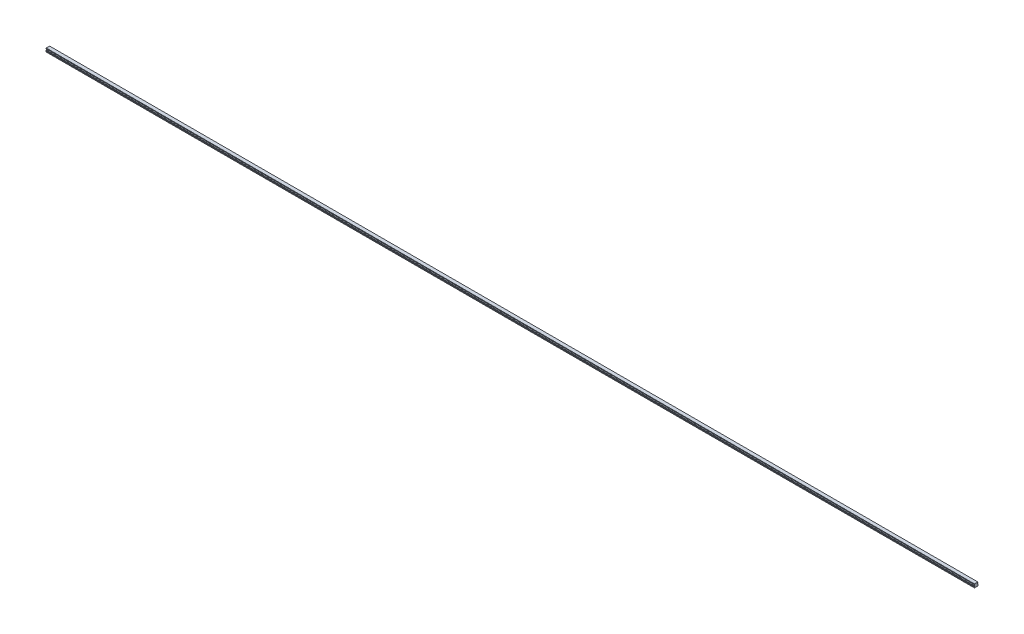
from build123d import *

# Parameters (mm, degrees)
BOSS_EXTRUDE1_DEPTH        = 3600
SKETCH3_R                  = 2.5
SKETCH3_R_2                = 2.1
CUT_EXTRUDE3_DEPTH         = 7
SKETCH3_2_R                = 2.1
CUT_EXTRUDE4_DEPTH         = 9.5
CHAMFER1_SIZE              = 0.4
LPATTERN2_COUNT            = 60
LPATTERN2_PITCH            = 60
CHAMFER1_OF_LPATTERN2_SIZE = 0.4


with BuildPart() as part:
    # Sketch1 → Boss-Extrude1 (new body)
    with BuildSketch(Plane(origin=(0, 0, 0), x_dir=(0, 0, -1), z_dir=(1, 0, 0))):
        with BuildLine():
            Line((6.59, 14), (-6.59, 14))
            Line((-6.59, 14), (-6.59, 13.15))
            Line((-6.59, 13.15), (-6.96, 12.356532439))
            Line((-6.96, 12.356532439), (-6.96, 11.435174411))
            ThreePointArc((-6.96, 11.435174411), (-5.25, 9.5), (-6.96, 7.564825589))
            Line((-6.96, 7.564825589), (-6.96, 6.643467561))
            Line((-6.96, 6.643467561), (-6.59, 5.85))
            Line((-6.59, 5.85), (-7.032116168, 4.2))
            Line((-7.032116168, 4.2), (-7.5, 3.929867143))
            Line((-7.5, 3.929867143), (-7.5, 1.4))
            Line((-7.5, 1.4), (-6.1, 0))
            Line((-6.1, 0), (-3.65, 0))
            Line((-3.65, 0), (-3.25, 0.4))
            Line((-3.25, 0.4), (3.25, 0.4))
            Line((3.25, 0.4), (3.65, 0))
            Line((3.65, 0), (6.1, 0))
            Line((6.1, 0), (7.5, 1.4))
            Line((7.5, 1.4), (7.5, 3.929867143))
            Line((7.5, 3.929867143), (7.032116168, 4.2))
            Line((7.032116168, 4.2), (6.59, 5.85))
            Line((6.59, 5.85), (6.96, 6.643467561))
            Line((6.96, 6.643467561), (6.96, 7.564825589))
            ThreePointArc((6.96, 7.564825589), (5.25, 9.5), (6.96, 11.435174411))
            Line((6.96, 11.435174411), (6.96, 12.356532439))
            Line((6.96, 12.356532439), (6.59, 13.15))
            Line((6.59, 13.15), (6.59, 14))
        make_face()
    extrude(amount=BOSS_EXTRUDE1_DEPTH)

    # Sketch3 → Cut-Extrude3 (cut)
    with BuildSketch(Plane.XZ):
        with Locations(Location((30, 0, 0), (0, 0, 270))):
            Circle(SKETCH3_R)
        with Locations(Location((30, 0, 0), (0, 0, 270))):
            Circle(SKETCH3_R_2, mode=Mode.SUBTRACT)
    cut_extrude3 = extrude(amount=-CUT_EXTRUDE3_DEPTH, mode=Mode.SUBTRACT)

    # Sketch3_2 → Cut-Extrude4 (cut)
    with BuildSketch(Plane.XZ):
        with Locations(Location((30, 0, 0), (0, 0, 270))):
            Circle(SKETCH3_2_R)
    cut_extrude4 = extrude(amount=-CUT_EXTRUDE4_DEPTH, mode=Mode.SUBTRACT)

    # Cut-Extrude5 cone 1 section (on through the dimple's axis) → Cut-Extrude5 (revolve, cut)
    with BuildSketch(Plane(origin=(30, 9.5, 0), x_dir=(0, 0, -1), z_dir=(1, 0, 0))):
        Polygon((0, 0), (2.1, 0), (0, 1.212435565), align=None)
    revolve(axis=Axis((30, 9.5, 0), (0, 1, 0)), mode=Mode.SUBTRACT)

    # Chamfer1
    chamfer1_edges = [part.edges().sort_by_distance(p)[0] for p in [
        (30, 0.4, 2.5),
    ]]
    chamfer(chamfer1_edges, length=CHAMFER1_SIZE)

    # LPattern2: Cut-Extrude3, Cut-Extrude4 ×60
    with Locations(*[(i * LPATTERN2_PITCH, 0, 0) for i in range(1, LPATTERN2_COUNT)]):
        add(cut_extrude3, mode=Mode.SUBTRACT)
        add(cut_extrude4, mode=Mode.SUBTRACT)

    # Chamfer1 of LPattern2
    chamfer1_of_lpattern2_edges = [part.edges().sort_by_distance(p)[0] for p in [
        (90, 0.4, 2.5),
        (150, 0.4, 2.5),
        (210, 0.4, 2.5),
        (270, 0.4, 2.5),
        (330, 0.4, 2.5),
        (390, 0.4, 2.5),
        (450, 0.4, 2.5),
        (510, 0.4, 2.5),
        (570, 0.4, 2.5),
        (630, 0.4, 2.5),
        (690, 0.4, 2.5),
        (750, 0.4, 2.5),
        (810, 0.4, 2.5),
        (870, 0.4, 2.5),
        (930, 0.4, 2.5),
        (990, 0.4, 2.5),
        (1050, 0.4, 2.5),
        (1110, 0.4, 2.5),
        (1170, 0.4, 2.5),
        (1230, 0.4, 2.5),
        (1290, 0.4, 2.5),
        (1350, 0.4, 2.5),
        (1410, 0.4, 2.5),
        (1470, 0.4, 2.5),
        (1530, 0.4, 2.5),
        (1590, 0.4, 2.5),
        (1650, 0.4, 2.5),
        (1710, 0.4, 2.5),
        (1770, 0.4, 2.5),
        (1830, 0.4, 2.5),
        (1890, 0.4, 2.5),
        (1950, 0.4, 2.5),
        (2010, 0.4, 2.5),
        (2070, 0.4, 2.5),
        (2130, 0.4, 2.5),
        (2190, 0.4, 2.5),
        (2250, 0.4, 2.5),
        (2310, 0.4, 2.5),
        (2370, 0.4, 2.5),
        (2430, 0.4, 2.5),
        (2490, 0.4, 2.5),
        (2550, 0.4, 2.5),
        (2610, 0.4, 2.5),
        (2670, 0.4, 2.5),
        (2730, 0.4, 2.5),
        (2790, 0.4, 2.5),
        (2850, 0.4, 2.5),
        (2910, 0.4, 2.5),
        (2970, 0.4, 2.5),
        (3030, 0.4, 2.5),
        (3090, 0.4, 2.5),
        (3150, 0.4, 2.5),
        (3210, 0.4, 2.5),
        (3270, 0.4, 2.5),
        (3330, 0.4, 2.5),
        (3390, 0.4, 2.5),
        (3450, 0.4, 2.5),
        (3510, 0.4, 2.5),
        (3570, 0.4, 2.5),
    ]]
    chamfer(chamfer1_of_lpattern2_edges, length=CHAMFER1_OF_LPATTERN2_SIZE)


solid = part.part
